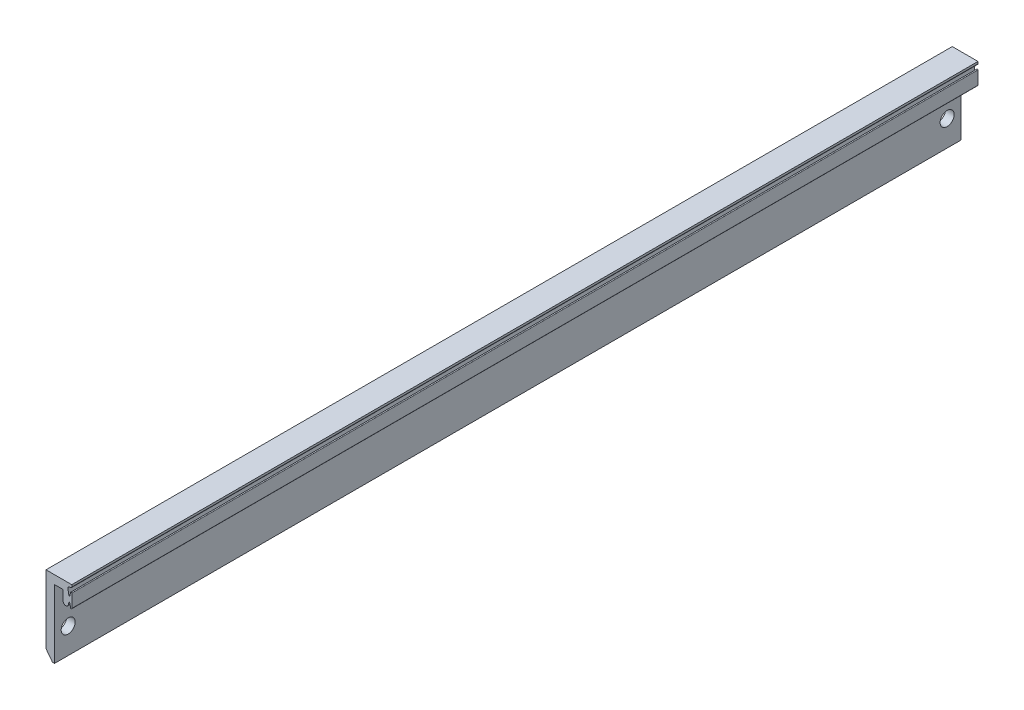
from build123d import *

# Parameters (mm, degrees)
EXTRUDE_1_DEPTH     = 132.675
SKETCH_2_R          = 2.05
CUT_EXTRUDE_1_DEPTH = 3262.085844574


with BuildPart() as part:
    # Sketch 1 → Extrude 1 (new, symmetric)
    with BuildSketch(Plane.XY):
        with BuildLine():
            Line((2475.892586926, -3235.877107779), (2468.352586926, -3235.877107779))
            Line((2468.352586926, -3235.877107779), (2468.352586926, -3255.877107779))
            Line((2468.352586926, -3255.877107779), (2470.252586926, -3258.377107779))
            Line((2470.252586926, -3258.377107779), (2470.852586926, -3258.377107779))
            Line((2470.852586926, -3258.377107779), (2470.852586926, -3238.377107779))
            Line((2470.852586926, -3238.377107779), (2473.352586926, -3238.377107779))
            Line((2473.352586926, -3238.377107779), (2473.352586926, -3241.243397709))
            Line((2473.352586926, -3241.243397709), (2473.352586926, -3241.293845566))
            ThreePointArc((2473.352586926, -3241.293845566), (2474.054120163, -3242.072633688), (2474.901701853, -3241.455977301))
            Line((2474.901701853, -3241.455977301), (2475.034328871, -3240.829314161))
            ThreePointArc((2475.034328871, -3240.829314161), (2475.03583749, -3240.821049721), (2475.037806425, -3240.812882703))
            ThreePointArc((2475.037806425, -3240.812882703), (2475.187472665, -3240.702187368), (2475.32961412, -3240.82239239))
            Line((2475.32961412, -3240.82239239), (2475.555828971, -3241.941668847))
            ThreePointArc((2475.555828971, -3241.941668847), (2475.742824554, -3242.076887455), (2475.892586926, -3241.901323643))
            Line((2475.892586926, -3241.901323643), (2475.892586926, -3241.864607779))
            Line((2475.892586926, -3241.864607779), (2475.892586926, -3238.052891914))
            Line((2475.892586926, -3238.052891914), (2475.892586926, -3238.039607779))
            ThreePointArc((2475.892586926, -3238.039607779), (2475.738732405, -3237.876887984), (2475.556904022, -3238.007606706))
            Line((2475.556904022, -3238.007606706), (2475.328666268, -3238.986178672))
            ThreePointArc((2475.328666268, -3238.986178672), (2475.174172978, -3239.101871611), (2475.03361058, -3238.969602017))
            ThreePointArc((2475.03361058, -3238.969602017), (2474.869641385, -3238.052288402), (2474.839643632, -3237.120918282))
            ThreePointArc((2474.839643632, -3237.120918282), (2474.914894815, -3236.933969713), (2475.091454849, -3236.836814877))
            Line((2475.091454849, -3236.836814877), (2475.640533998, -3236.747916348))
            ThreePointArc((2475.640533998, -3236.747916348), (2475.821042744, -3236.646215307), (2475.892586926, -3236.45177267))
            Line((2475.892586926, -3236.45177267), (2475.892586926, -3235.877107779))
        make_face()
    extrude(amount=EXTRUDE_1_DEPTH, both=True)

    # Sketch 2 → Cut-Extrude 1 (cut, through all)
    with BuildSketch(Plane.ZY.offset(-2468.352586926)):
        with Locations(Location((-128.675, -3250.877107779, 0), (0, 0, 270))):
            Circle(SKETCH_2_R)
        with Locations(Location((128.675, -3250.877107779, 0), (0, 0, 90))):
            Circle(SKETCH_2_R)
    extrude(amount=-CUT_EXTRUDE_1_DEPTH, mode=Mode.SUBTRACT)


solid = part.part
